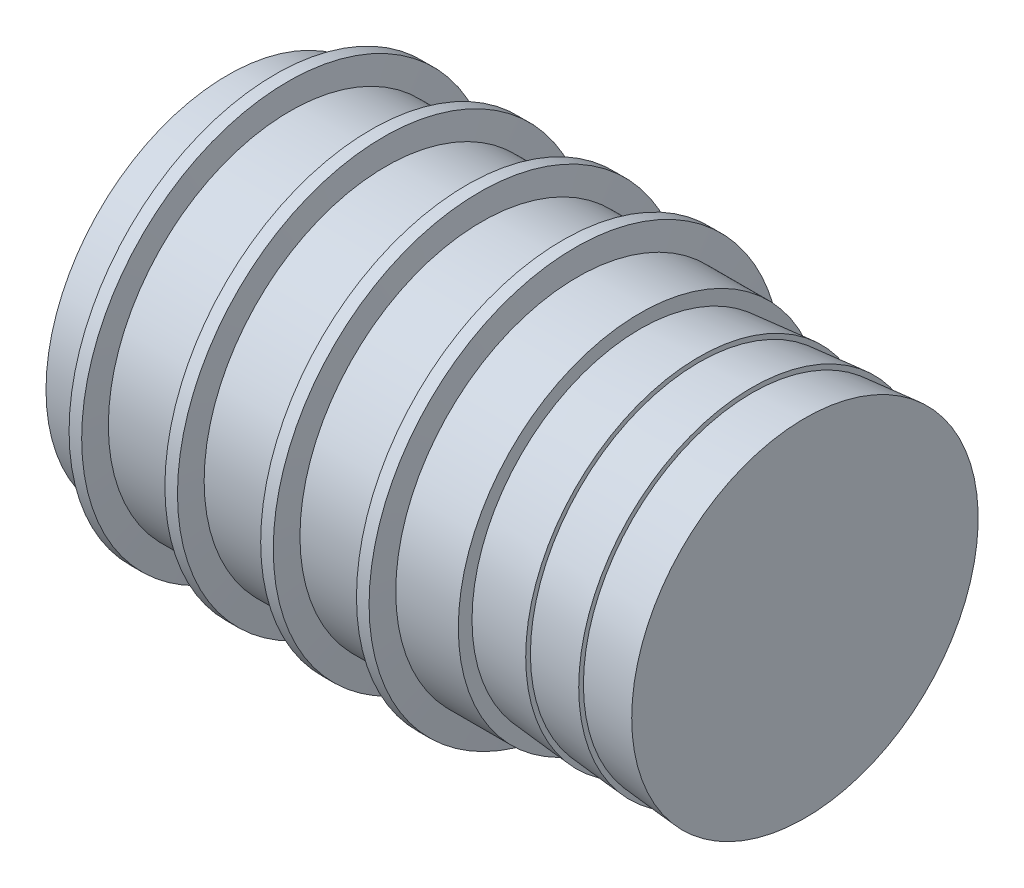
ISO-10303-21;
HEADER;
FILE_DESCRIPTION(('STEP AP214'),'2;1');
FILE_NAME('part.step','',(''),(''),'','','');
FILE_SCHEMA(('AUTOMOTIVE_DESIGN { 1 0 10303 214 1 1 1 1 }'));
ENDSEC;
DATA;
#1=APPLICATION_CONTEXT('core data for automotive mechanical design processes');
#2=APPLICATION_PROTOCOL_DEFINITION('international standard','automotive_design',2000,#1);
#3=PRODUCT_CONTEXT('',#1,'mechanical');
#4=PRODUCT('Part','Part','',(#3));
#5=PRODUCT_RELATED_PRODUCT_CATEGORY('part','',(#4));
#6=PRODUCT_DEFINITION_FORMATION('','',#4);
#7=PRODUCT_DEFINITION_CONTEXT('part definition',#1,'design');
#8=PRODUCT_DEFINITION('design','',#6,#7);
#9=PRODUCT_DEFINITION_SHAPE('','',#8);
#10=(LENGTH_UNIT() NAMED_UNIT(*) SI_UNIT(.MILLI.,.METRE.));
#11=(NAMED_UNIT(*) PLANE_ANGLE_UNIT() SI_UNIT($,.RADIAN.));
#12=(NAMED_UNIT(*) SI_UNIT($,.STERADIAN.) SOLID_ANGLE_UNIT());
#13=UNCERTAINTY_MEASURE_WITH_UNIT(LENGTH_MEASURE(1.E-05),#10,'distance_accuracy_value','');
#14=(GEOMETRIC_REPRESENTATION_CONTEXT(3) GLOBAL_UNCERTAINTY_ASSIGNED_CONTEXT((#13)) GLOBAL_UNIT_ASSIGNED_CONTEXT((#10,
#11,#12)) REPRESENTATION_CONTEXT('',''));
#15=CARTESIAN_POINT('',(0.,0.,0.));
#16=DIRECTION('',(0.,0.,1.));
#17=DIRECTION('',(1.,0.,0.));
#18=AXIS2_PLACEMENT_3D('',#15,#16,#17);
#19=CARTESIAN_POINT('',(14.,0.,0.));
#20=DIRECTION('',(1.,0.,0.));
#21=DIRECTION('',(0.,0.,-1.));
#22=AXIS2_PLACEMENT_3D('',#19,#20,#21);
#23=PLANE('',#22);
#24=CARTESIAN_POINT('',(14.,0.,0.));
#25=DIRECTION('',(-1.,0.,0.));
#26=DIRECTION('',(0.,0.,1.));
#27=AXIS2_PLACEMENT_3D('',#24,#25,#26);
#28=CIRCLE('',#27,4.20134201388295);
#29=CARTESIAN_POINT('',(14.,0.,4.20134201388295));
#30=VERTEX_POINT('',#29);
#31=EDGE_CURVE('E9',#30,#30,#28,.T.);
#32=ORIENTED_EDGE('',*,*,#31,.F.);
#33=EDGE_LOOP('',(#32));
#34=FACE_BOUND('',#33,.T.);
#35=ADVANCED_FACE('F14',(#34),#23,.T.);
#36=CARTESIAN_POINT('',(12.7144174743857,0.,0.));
#37=DIRECTION('',(1.,0.,0.));
#38=DIRECTION('',(0.,0.,-1.));
#39=AXIS2_PLACEMENT_3D('',#36,#37,#38);
#40=CONICAL_SURFACE('',#39,4.08715670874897,0.0885874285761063);
#41=ORIENTED_EDGE('',*,*,#31,.T.);
#42=EDGE_LOOP('',(#41));
#43=FACE_BOUND('',#42,.T.);
#44=CARTESIAN_POINT('',(12.7144174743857,0.,0.));
#45=DIRECTION('',(-1.,0.,0.));
#46=DIRECTION('',(0.,0.,1.));
#47=AXIS2_PLACEMENT_3D('',#44,#45,#46);
#48=CIRCLE('',#47,4.08715670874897);
#49=CARTESIAN_POINT('',(12.7144174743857,0.,4.08715670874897));
#50=VERTEX_POINT('',#49);
#51=EDGE_CURVE('E20',#50,#50,#48,.T.);
#52=ORIENTED_EDGE('',*,*,#51,.F.);
#53=EDGE_LOOP('',(#52));
#54=FACE_BOUND('',#53,.T.);
#55=ADVANCED_FACE('F146',(#43,#54),#40,.T.);
#56=CARTESIAN_POINT('',(12.7144174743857,0.,0.));
#57=DIRECTION('',(1.,0.,0.));
#58=DIRECTION('',(0.,0.,-1.));
#59=AXIS2_PLACEMENT_3D('',#56,#57,#58);
#60=PLANE('',#59);
#61=ORIENTED_EDGE('',*,*,#51,.T.);
#62=EDGE_LOOP('',(#61));
#63=FACE_BOUND('',#62,.T.);
#64=CARTESIAN_POINT('',(12.7144174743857,0.,0.));
#65=DIRECTION('',(-1.,0.,0.));
#66=DIRECTION('',(0.,0.,1.));
#67=AXIS2_PLACEMENT_3D('',#64,#65,#66);
#68=CIRCLE('',#67,4.20134201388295);
#69=CARTESIAN_POINT('',(12.7144174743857,0.,4.20134201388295));
#70=VERTEX_POINT('',#69);
#71=EDGE_CURVE('E24',#70,#70,#68,.T.);
#72=ORIENTED_EDGE('',*,*,#71,.F.);
#73=EDGE_LOOP('',(#72));
#74=FACE_BOUND('',#73,.T.);
#75=ADVANCED_FACE('F152',(#63,#74),#60,.T.);
#76=CARTESIAN_POINT('',(11.4288349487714,0.,0.));
#77=DIRECTION('',(1.,0.,0.));
#78=DIRECTION('',(0.,0.,-1.));
#79=AXIS2_PLACEMENT_3D('',#76,#77,#78);
#80=CONICAL_SURFACE('',#79,4.08715670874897,0.0885874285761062);
#81=ORIENTED_EDGE('',*,*,#71,.T.);
#82=EDGE_LOOP('',(#81));
#83=FACE_BOUND('',#82,.T.);
#84=CARTESIAN_POINT('',(11.4288349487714,0.,0.));
#85=DIRECTION('',(-1.,0.,0.));
#86=DIRECTION('',(0.,0.,1.));
#87=AXIS2_PLACEMENT_3D('',#84,#85,#86);
#88=CIRCLE('',#87,4.08715670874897);
#89=CARTESIAN_POINT('',(11.4288349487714,0.,4.08715670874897));
#90=VERTEX_POINT('',#89);
#91=EDGE_CURVE('E28',#90,#90,#88,.T.);
#92=ORIENTED_EDGE('',*,*,#91,.F.);
#93=EDGE_LOOP('',(#92));
#94=FACE_BOUND('',#93,.T.);
#95=ADVANCED_FACE('F157',(#83,#94),#80,.T.);
#96=CARTESIAN_POINT('',(11.4288349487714,0.,0.));
#97=DIRECTION('',(1.,0.,0.));
#98=DIRECTION('',(0.,0.,-1.));
#99=AXIS2_PLACEMENT_3D('',#96,#97,#98);
#100=PLANE('',#99);
#101=ORIENTED_EDGE('',*,*,#91,.T.);
#102=EDGE_LOOP('',(#101));
#103=FACE_BOUND('',#102,.T.);
#104=CARTESIAN_POINT('',(11.4288349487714,0.,0.));
#105=DIRECTION('',(-1.,0.,0.));
#106=DIRECTION('',(0.,0.,1.));
#107=AXIS2_PLACEMENT_3D('',#104,#105,#106);
#108=CIRCLE('',#107,4.20134201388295);
#109=CARTESIAN_POINT('',(11.4288349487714,0.,4.20134201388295));
#110=VERTEX_POINT('',#109);
#111=EDGE_CURVE('E33',#110,#110,#108,.T.);
#112=ORIENTED_EDGE('',*,*,#111,.F.);
#113=EDGE_LOOP('',(#112));
#114=FACE_BOUND('',#113,.T.);
#115=ADVANCED_FACE('F163',(#103,#114),#100,.T.);
#116=CARTESIAN_POINT('',(10.,0.,0.));
#117=DIRECTION('',(1.,0.,0.));
#118=DIRECTION('',(0.,0.,-1.));
#119=AXIS2_PLACEMENT_3D('',#116,#117,#118);
#120=CONICAL_SURFACE('',#119,4.07443304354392,0.0885874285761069);
#121=ORIENTED_EDGE('',*,*,#111,.T.);
#122=EDGE_LOOP('',(#121));
#123=FACE_BOUND('',#122,.T.);
#124=CARTESIAN_POINT('',(10.,0.,0.));
#125=DIRECTION('',(-1.,0.,0.));
#126=DIRECTION('',(0.,0.,1.));
#127=AXIS2_PLACEMENT_3D('',#124,#125,#126);
#128=CIRCLE('',#127,4.07443304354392);
#129=CARTESIAN_POINT('',(10.,0.,4.07443304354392));
#130=VERTEX_POINT('',#129);
#131=EDGE_CURVE('E36',#130,#130,#128,.T.);
#132=ORIENTED_EDGE('',*,*,#131,.F.);
#133=EDGE_LOOP('',(#132));
#134=FACE_BOUND('',#133,.T.);
#135=ADVANCED_FACE('F167',(#123,#134),#120,.T.);
#136=CARTESIAN_POINT('',(10.,0.,0.));
#137=DIRECTION('',(1.,0.,0.));
#138=DIRECTION('',(0.,0.,-1.));
#139=AXIS2_PLACEMENT_3D('',#136,#137,#138);
#140=PLANE('',#139);
#141=ORIENTED_EDGE('',*,*,#131,.T.);
#142=EDGE_LOOP('',(#141));
#143=FACE_BOUND('',#142,.T.);
#144=CARTESIAN_POINT('',(10.,0.,0.));
#145=DIRECTION('',(-1.,0.,0.));
#146=DIRECTION('',(0.,0.,1.));
#147=AXIS2_PLACEMENT_3D('',#144,#145,#146);
#148=CIRCLE('',#147,4.40692807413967);
#149=CARTESIAN_POINT('',(10.,0.,4.40692807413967));
#150=VERTEX_POINT('',#149);
#151=EDGE_CURVE('E39',#150,#150,#148,.T.);
#152=ORIENTED_EDGE('',*,*,#151,.F.);
#153=EDGE_LOOP('',(#152));
#154=FACE_BOUND('',#153,.T.);
#155=ADVANCED_FACE('F171',(#143,#154),#140,.T.);
#156=CARTESIAN_POINT('',(0.,0.,0.));
#157=DIRECTION('',(-1.,0.,0.));
#158=DIRECTION('',(0.,0.,1.));
#159=AXIS2_PLACEMENT_3D('',#156,#157,#158);
#160=CYLINDRICAL_SURFACE('',#159,4.40692807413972);
#161=CARTESIAN_POINT('',(8.48265334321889,0.,0.));
#162=DIRECTION('',(-1.,0.,0.));
#163=DIRECTION('',(0.,0.,1.));
#164=AXIS2_PLACEMENT_3D('',#161,#162,#163);
#165=CIRCLE('',#164,4.40692807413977);
#166=CARTESIAN_POINT('',(8.48265334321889,0.,4.40692807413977));
#167=VERTEX_POINT('',#166);
#168=EDGE_CURVE('E42',#167,#167,#165,.T.);
#169=ORIENTED_EDGE('',*,*,#168,.F.);
#170=EDGE_LOOP('',(#169));
#171=FACE_BOUND('',#170,.T.);
#172=ORIENTED_EDGE('',*,*,#151,.T.);
#173=EDGE_LOOP('',(#172));
#174=FACE_BOUND('',#173,.T.);
#175=ADVANCED_FACE('F175',(#171,#174),#160,.T.);
#176=CARTESIAN_POINT('',(8.48265334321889,0.,0.));
#177=DIRECTION('',(-1.,0.,0.));
#178=DIRECTION('',(0.,0.,1.));
#179=AXIS2_PLACEMENT_3D('',#176,#177,#178);
#180=CONICAL_SURFACE('',#179,4.40692807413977,1.48000585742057);
#181=CARTESIAN_POINT('',(8.42865962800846,0.,0.));
#182=DIRECTION('',(-1.,0.,0.));
#183=DIRECTION('',(0.,0.,1.));
#184=AXIS2_PLACEMENT_3D('',#181,#182,#183);
#185=CIRCLE('',#184,5.0000000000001);
#186=CARTESIAN_POINT('',(8.42865962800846,0.,5.0000000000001));
#187=VERTEX_POINT('',#186);
#188=EDGE_CURVE('E45',#187,#187,#185,.T.);
#189=ORIENTED_EDGE('',*,*,#188,.F.);
#190=EDGE_LOOP('',(#189));
#191=FACE_BOUND('',#190,.T.);
#192=ORIENTED_EDGE('',*,*,#168,.T.);
#193=EDGE_LOOP('',(#192));
#194=FACE_BOUND('',#193,.T.);
#195=ADVANCED_FACE('F179',(#191,#194),#180,.T.);
#196=CARTESIAN_POINT('',(0.,0.,0.));
#197=DIRECTION('',(-1.,0.,0.));
#198=DIRECTION('',(0.,0.,1.));
#199=AXIS2_PLACEMENT_3D('',#196,#197,#198);
#200=CYLINDRICAL_SURFACE('',#199,5.0000000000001);
#201=ORIENTED_EDGE('',*,*,#188,.T.);
#202=EDGE_LOOP('',(#201));
#203=FACE_BOUND('',#202,.T.);
#204=CARTESIAN_POINT('',(8.12328147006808,0.,0.));
#205=DIRECTION('',(-1.,0.,0.));
#206=DIRECTION('',(0.,0.,1.));
#207=AXIS2_PLACEMENT_3D('',#204,#205,#206);
#208=CIRCLE('',#207,5.0000000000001);
#209=CARTESIAN_POINT('',(8.12328147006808,0.,5.0000000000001));
#210=VERTEX_POINT('',#209);
#211=EDGE_CURVE('E48',#210,#210,#208,.T.);
#212=ORIENTED_EDGE('',*,*,#211,.F.);
#213=EDGE_LOOP('',(#212));
#214=FACE_BOUND('',#213,.T.);
#215=ADVANCED_FACE('F183',(#203,#214),#200,.T.);
#216=CARTESIAN_POINT('',(8.06928775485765,0.,0.));
#217=DIRECTION('',(1.,0.,0.));
#218=DIRECTION('',(0.,0.,-1.));
#219=AXIS2_PLACEMENT_3D('',#216,#217,#218);
#220=CONICAL_SURFACE('',#219,4.40692807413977,1.48000585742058);
#221=ORIENTED_EDGE('',*,*,#211,.T.);
#222=EDGE_LOOP('',(#221));
#223=FACE_BOUND('',#222,.T.);
#224=CARTESIAN_POINT('',(8.06928775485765,0.,0.));
#225=DIRECTION('',(-1.,0.,0.));
#226=DIRECTION('',(0.,0.,1.));
#227=AXIS2_PLACEMENT_3D('',#224,#225,#226);
#228=CIRCLE('',#227,4.40692807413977);
#229=CARTESIAN_POINT('',(8.06928775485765,0.,4.40692807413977));
#230=VERTEX_POINT('',#229);
#231=EDGE_CURVE('E51',#230,#230,#228,.T.);
#232=ORIENTED_EDGE('',*,*,#231,.F.);
#233=EDGE_LOOP('',(#232));
#234=FACE_BOUND('',#233,.T.);
#235=ADVANCED_FACE('F187',(#223,#234),#220,.T.);
#236=CARTESIAN_POINT('',(0.,0.,0.));
#237=DIRECTION('',(-1.,0.,0.));
#238=DIRECTION('',(0.,0.,1.));
#239=AXIS2_PLACEMENT_3D('',#236,#237,#238);
#240=CYLINDRICAL_SURFACE('',#239,4.40692807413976);
#241=CARTESIAN_POINT('',(6.15915877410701,0.,0.));
#242=DIRECTION('',(-1.,0.,0.));
#243=DIRECTION('',(0.,0.,1.));
#244=AXIS2_PLACEMENT_3D('',#241,#242,#243);
#245=CIRCLE('',#244,4.40692807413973);
#246=CARTESIAN_POINT('',(6.15915877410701,0.,4.40692807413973));
#247=VERTEX_POINT('',#246);
#248=EDGE_CURVE('E54',#247,#247,#245,.T.);
#249=ORIENTED_EDGE('',*,*,#248,.F.);
#250=EDGE_LOOP('',(#249));
#251=FACE_BOUND('',#250,.T.);
#252=ORIENTED_EDGE('',*,*,#231,.T.);
#253=EDGE_LOOP('',(#252));
#254=FACE_BOUND('',#253,.T.);
#255=ADVANCED_FACE('F191',(#251,#254),#240,.T.);
#256=CARTESIAN_POINT('',(6.15915877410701,0.,0.));
#257=DIRECTION('',(-1.,0.,0.));
#258=DIRECTION('',(0.,0.,1.));
#259=AXIS2_PLACEMENT_3D('',#256,#257,#258);
#260=CONICAL_SURFACE('',#259,4.40692807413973,1.48000585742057);
#261=CARTESIAN_POINT('',(6.10516505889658,0.,0.));
#262=DIRECTION('',(-1.,0.,0.));
#263=DIRECTION('',(0.,0.,1.));
#264=AXIS2_PLACEMENT_3D('',#261,#262,#263);
#265=CIRCLE('',#264,5.00000000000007);
#266=CARTESIAN_POINT('',(6.10516505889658,0.,5.00000000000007));
#267=VERTEX_POINT('',#266);
#268=EDGE_CURVE('E57',#267,#267,#265,.T.);
#269=ORIENTED_EDGE('',*,*,#268,.F.);
#270=EDGE_LOOP('',(#269));
#271=FACE_BOUND('',#270,.T.);
#272=ORIENTED_EDGE('',*,*,#248,.T.);
#273=EDGE_LOOP('',(#272));
#274=FACE_BOUND('',#273,.T.);
#275=ADVANCED_FACE('F195',(#271,#274),#260,.T.);
#276=CARTESIAN_POINT('',(0.,0.,0.));
#277=DIRECTION('',(-1.,0.,0.));
#278=DIRECTION('',(0.,0.,1.));
#279=AXIS2_PLACEMENT_3D('',#276,#277,#278);
#280=CYLINDRICAL_SURFACE('',#279,5.00000000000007);
#281=ORIENTED_EDGE('',*,*,#268,.T.);
#282=EDGE_LOOP('',(#281));
#283=FACE_BOUND('',#282,.T.);
#284=CARTESIAN_POINT('',(5.7997869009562,0.,0.));
#285=DIRECTION('',(-1.,0.,0.));
#286=DIRECTION('',(0.,0.,1.));
#287=AXIS2_PLACEMENT_3D('',#284,#285,#286);
#288=CIRCLE('',#287,5.00000000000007);
#289=CARTESIAN_POINT('',(5.7997869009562,0.,5.00000000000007));
#290=VERTEX_POINT('',#289);
#291=EDGE_CURVE('E60',#290,#290,#288,.T.);
#292=ORIENTED_EDGE('',*,*,#291,.F.);
#293=EDGE_LOOP('',(#292));
#294=FACE_BOUND('',#293,.T.);
#295=ADVANCED_FACE('F199',(#283,#294),#280,.T.);
#296=CARTESIAN_POINT('',(5.74579318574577,0.,0.));
#297=DIRECTION('',(1.,0.,0.));
#298=DIRECTION('',(0.,0.,-1.));
#299=AXIS2_PLACEMENT_3D('',#296,#297,#298);
#300=CONICAL_SURFACE('',#299,4.40692807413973,1.48000585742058);
#301=ORIENTED_EDGE('',*,*,#291,.T.);
#302=EDGE_LOOP('',(#301));
#303=FACE_BOUND('',#302,.T.);
#304=CARTESIAN_POINT('',(5.74579318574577,0.,0.));
#305=DIRECTION('',(-1.,0.,0.));
#306=DIRECTION('',(0.,0.,1.));
#307=AXIS2_PLACEMENT_3D('',#304,#305,#306);
#308=CIRCLE('',#307,4.40692807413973);
#309=CARTESIAN_POINT('',(5.74579318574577,0.,4.40692807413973));
#310=VERTEX_POINT('',#309);
#311=EDGE_CURVE('E63',#310,#310,#308,.T.);
#312=ORIENTED_EDGE('',*,*,#311,.F.);
#313=EDGE_LOOP('',(#312));
#314=FACE_BOUND('',#313,.T.);
#315=ADVANCED_FACE('F203',(#303,#314),#300,.T.);
#316=CARTESIAN_POINT('',(0.,0.,0.));
#317=DIRECTION('',(-1.,0.,0.));
#318=DIRECTION('',(0.,0.,1.));
#319=AXIS2_PLACEMENT_3D('',#316,#317,#318);
#320=CYLINDRICAL_SURFACE('',#319,4.40692807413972);
#321=CARTESIAN_POINT('',(3.83566420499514,0.,0.));
#322=DIRECTION('',(-1.,0.,0.));
#323=DIRECTION('',(0.,0.,1.));
#324=AXIS2_PLACEMENT_3D('',#321,#322,#323);
#325=CIRCLE('',#324,4.4069280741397);
#326=CARTESIAN_POINT('',(3.83566420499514,0.,4.4069280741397));
#327=VERTEX_POINT('',#326);
#328=EDGE_CURVE('E66',#327,#327,#325,.T.);
#329=ORIENTED_EDGE('',*,*,#328,.F.);
#330=EDGE_LOOP('',(#329));
#331=FACE_BOUND('',#330,.T.);
#332=ORIENTED_EDGE('',*,*,#311,.T.);
#333=EDGE_LOOP('',(#332));
#334=FACE_BOUND('',#333,.T.);
#335=ADVANCED_FACE('F207',(#331,#334),#320,.T.);
#336=CARTESIAN_POINT('',(3.83566420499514,0.,0.));
#337=DIRECTION('',(-1.,0.,0.));
#338=DIRECTION('',(0.,0.,1.));
#339=AXIS2_PLACEMENT_3D('',#336,#337,#338);
#340=CONICAL_SURFACE('',#339,4.4069280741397,1.48000585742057);
#341=CARTESIAN_POINT('',(3.7816704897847,0.,0.));
#342=DIRECTION('',(-1.,0.,0.));
#343=DIRECTION('',(0.,0.,1.));
#344=AXIS2_PLACEMENT_3D('',#341,#342,#343);
#345=CIRCLE('',#344,5.);
#346=CARTESIAN_POINT('',(3.7816704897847,0.,5.));
#347=VERTEX_POINT('',#346);
#348=EDGE_CURVE('E69',#347,#347,#345,.T.);
#349=ORIENTED_EDGE('',*,*,#348,.F.);
#350=EDGE_LOOP('',(#349));
#351=FACE_BOUND('',#350,.T.);
#352=ORIENTED_EDGE('',*,*,#328,.T.);
#353=EDGE_LOOP('',(#352));
#354=FACE_BOUND('',#353,.T.);
#355=ADVANCED_FACE('F211',(#351,#354),#340,.T.);
#356=CARTESIAN_POINT('',(0.,0.,0.));
#357=DIRECTION('',(-1.,0.,0.));
#358=DIRECTION('',(0.,0.,1.));
#359=AXIS2_PLACEMENT_3D('',#356,#357,#358);
#360=CYLINDRICAL_SURFACE('',#359,5.);
#361=ORIENTED_EDGE('',*,*,#348,.T.);
#362=EDGE_LOOP('',(#361));
#363=FACE_BOUND('',#362,.T.);
#364=CARTESIAN_POINT('',(3.47629233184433,0.,0.));
#365=DIRECTION('',(-1.,0.,0.));
#366=DIRECTION('',(0.,0.,1.));
#367=AXIS2_PLACEMENT_3D('',#364,#365,#366);
#368=CIRCLE('',#367,5.);
#369=CARTESIAN_POINT('',(3.47629233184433,0.,5.));
#370=VERTEX_POINT('',#369);
#371=EDGE_CURVE('E72',#370,#370,#368,.T.);
#372=ORIENTED_EDGE('',*,*,#371,.F.);
#373=EDGE_LOOP('',(#372));
#374=FACE_BOUND('',#373,.T.);
#375=ADVANCED_FACE('F215',(#363,#374),#360,.T.);
#376=CARTESIAN_POINT('',(3.42229861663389,0.,0.));
#377=DIRECTION('',(1.,0.,0.));
#378=DIRECTION('',(0.,0.,-1.));
#379=AXIS2_PLACEMENT_3D('',#376,#377,#378);
#380=CONICAL_SURFACE('',#379,4.4069280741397,1.48000585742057);
#381=ORIENTED_EDGE('',*,*,#371,.T.);
#382=EDGE_LOOP('',(#381));
#383=FACE_BOUND('',#382,.T.);
#384=CARTESIAN_POINT('',(3.42229861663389,0.,0.));
#385=DIRECTION('',(-1.,0.,0.));
#386=DIRECTION('',(0.,0.,1.));
#387=AXIS2_PLACEMENT_3D('',#384,#385,#386);
#388=CIRCLE('',#387,4.4069280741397);
#389=CARTESIAN_POINT('',(3.42229861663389,0.,4.4069280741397));
#390=VERTEX_POINT('',#389);
#391=EDGE_CURVE('E75',#390,#390,#388,.T.);
#392=ORIENTED_EDGE('',*,*,#391,.F.);
#393=EDGE_LOOP('',(#392));
#394=FACE_BOUND('',#393,.T.);
#395=ADVANCED_FACE('F219',(#383,#394),#380,.T.);
#396=CARTESIAN_POINT('',(0.,0.,0.));
#397=DIRECTION('',(-1.,0.,0.));
#398=DIRECTION('',(0.,0.,1.));
#399=AXIS2_PLACEMENT_3D('',#396,#397,#398);
#400=CYLINDRICAL_SURFACE('',#399,4.40692807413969);
#401=CARTESIAN_POINT('',(1.51216963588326,0.,0.));
#402=DIRECTION('',(-1.,0.,0.));
#403=DIRECTION('',(0.,0.,1.));
#404=AXIS2_PLACEMENT_3D('',#401,#402,#403);
#405=CIRCLE('',#404,4.40692807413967);
#406=CARTESIAN_POINT('',(1.51216963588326,0.,4.40692807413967));
#407=VERTEX_POINT('',#406);
#408=EDGE_CURVE('E78',#407,#407,#405,.T.);
#409=ORIENTED_EDGE('',*,*,#408,.F.);
#410=EDGE_LOOP('',(#409));
#411=FACE_BOUND('',#410,.T.);
#412=ORIENTED_EDGE('',*,*,#391,.T.);
#413=EDGE_LOOP('',(#412));
#414=FACE_BOUND('',#413,.T.);
#415=ADVANCED_FACE('F223',(#411,#414),#400,.T.);
#416=CARTESIAN_POINT('',(1.51216963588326,0.,0.));
#417=DIRECTION('',(-1.,0.,0.));
#418=DIRECTION('',(0.,0.,1.));
#419=AXIS2_PLACEMENT_3D('',#416,#417,#418);
#420=CONICAL_SURFACE('',#419,4.40692807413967,1.48000585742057);
#421=CARTESIAN_POINT('',(1.45817592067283,0.,0.));
#422=DIRECTION('',(-1.,0.,0.));
#423=DIRECTION('',(0.,0.,1.));
#424=AXIS2_PLACEMENT_3D('',#421,#422,#423);
#425=CIRCLE('',#424,5.);
#426=CARTESIAN_POINT('',(1.45817592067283,0.,5.));
#427=VERTEX_POINT('',#426);
#428=EDGE_CURVE('E81',#427,#427,#425,.T.);
#429=ORIENTED_EDGE('',*,*,#428,.F.);
#430=EDGE_LOOP('',(#429));
#431=FACE_BOUND('',#430,.T.);
#432=ORIENTED_EDGE('',*,*,#408,.T.);
#433=EDGE_LOOP('',(#432));
#434=FACE_BOUND('',#433,.T.);
#435=ADVANCED_FACE('F227',(#431,#434),#420,.T.);
#436=CARTESIAN_POINT('',(0.,0.,0.));
#437=DIRECTION('',(-1.,0.,0.));
#438=DIRECTION('',(0.,0.,1.));
#439=AXIS2_PLACEMENT_3D('',#436,#437,#438);
#440=CYLINDRICAL_SURFACE('',#439,5.);
#441=ORIENTED_EDGE('',*,*,#428,.T.);
#442=EDGE_LOOP('',(#441));
#443=FACE_BOUND('',#442,.T.);
#444=CARTESIAN_POINT('',(1.15279776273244,0.,0.));
#445=DIRECTION('',(-1.,0.,0.));
#446=DIRECTION('',(0.,0.,1.));
#447=AXIS2_PLACEMENT_3D('',#444,#445,#446);
#448=CIRCLE('',#447,5.);
#449=CARTESIAN_POINT('',(1.15279776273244,0.,5.));
#450=VERTEX_POINT('',#449);
#451=EDGE_CURVE('E84',#450,#450,#448,.T.);
#452=ORIENTED_EDGE('',*,*,#451,.F.);
#453=EDGE_LOOP('',(#452));
#454=FACE_BOUND('',#453,.T.);
#455=ADVANCED_FACE('F142',(#443,#454),#440,.T.);
#456=CARTESIAN_POINT('',(1.09880404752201,0.,0.));
#457=DIRECTION('',(1.,0.,0.));
#458=DIRECTION('',(0.,0.,-1.));
#459=AXIS2_PLACEMENT_3D('',#456,#457,#458);
#460=CONICAL_SURFACE('',#459,4.40692807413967,1.48000585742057);
#461=ORIENTED_EDGE('',*,*,#451,.T.);
#462=EDGE_LOOP('',(#461));
#463=FACE_BOUND('',#462,.T.);
#464=CARTESIAN_POINT('',(1.09880404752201,0.,0.));
#465=DIRECTION('',(-1.,0.,0.));
#466=DIRECTION('',(0.,0.,1.));
#467=AXIS2_PLACEMENT_3D('',#464,#465,#466);
#468=CIRCLE('',#467,4.40692807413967);
#469=CARTESIAN_POINT('',(1.09880404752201,0.,4.40692807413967));
#470=VERTEX_POINT('',#469);
#471=EDGE_CURVE('E87',#470,#470,#468,.T.);
#472=ORIENTED_EDGE('',*,*,#471,.F.);
#473=EDGE_LOOP('',(#472));
#474=FACE_BOUND('',#473,.T.);
#475=ADVANCED_FACE('F134',(#463,#474),#460,.T.);
#476=CARTESIAN_POINT('',(0.,0.,0.));
#477=DIRECTION('',(-1.,0.,0.));
#478=DIRECTION('',(0.,0.,1.));
#479=AXIS2_PLACEMENT_3D('',#476,#477,#478);
#480=CYLINDRICAL_SURFACE('',#479,4.40692807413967);
#481=ORIENTED_EDGE('',*,*,#471,.T.);
#482=EDGE_LOOP('',(#481));
#483=FACE_BOUND('',#482,.T.);
#484=CARTESIAN_POINT('',(0.,0.,0.));
#485=DIRECTION('',(-1.,0.,0.));
#486=DIRECTION('',(0.,0.,1.));
#487=AXIS2_PLACEMENT_3D('',#484,#485,#486);
#488=CIRCLE('',#487,4.40692807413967);
#489=CARTESIAN_POINT('',(0.,0.,4.40692807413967));
#490=VERTEX_POINT('',#489);
#491=EDGE_CURVE('E90',#490,#490,#488,.T.);
#492=ORIENTED_EDGE('',*,*,#491,.F.);
#493=EDGE_LOOP('',(#492));
#494=FACE_BOUND('',#493,.T.);
#495=ADVANCED_FACE('F129',(#483,#494),#480,.T.);
#496=CARTESIAN_POINT('',(0.,0.,0.));
#497=DIRECTION('',(-1.,0.,0.));
#498=DIRECTION('',(0.,0.,1.));
#499=AXIS2_PLACEMENT_3D('',#496,#497,#498);
#500=PLANE('',#499);
#501=CARTESIAN_POINT('',(0.,0.,0.));
#502=DIRECTION('',(-1.,0.,0.));
#503=DIRECTION('',(0.,0.,1.));
#504=AXIS2_PLACEMENT_3D('',#501,#502,#503);
#505=CIRCLE('',#504,4.);
#506=CARTESIAN_POINT('',(0.,0.,4.));
#507=VERTEX_POINT('',#506);
#508=EDGE_CURVE('E96',#507,#507,#505,.T.);
#509=ORIENTED_EDGE('',*,*,#508,.F.);
#510=EDGE_LOOP('',(#509));
#511=FACE_BOUND('',#510,.T.);
#512=ORIENTED_EDGE('',*,*,#491,.T.);
#513=EDGE_LOOP('',(#512));
#514=FACE_BOUND('',#513,.T.);
#515=ADVANCED_FACE('F123',(#511,#514),#500,.T.);
#516=CARTESIAN_POINT('',(0.,0.,0.));
#517=DIRECTION('',(-1.,0.,0.));
#518=DIRECTION('',(0.,0.,1.));
#519=AXIS2_PLACEMENT_3D('',#516,#517,#518);
#520=CONICAL_SURFACE('',#519,4.,0.0349065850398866);
#521=CARTESIAN_POINT('',(2.,0.,0.));
#522=DIRECTION('',(-1.,0.,0.));
#523=DIRECTION('',(0.,0.,1.));
#524=AXIS2_PLACEMENT_3D('',#521,#522,#523);
#525=CIRCLE('',#524,3.93015846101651);
#526=CARTESIAN_POINT('',(2.,0.,3.93015846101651));
#527=VERTEX_POINT('',#526);
#528=EDGE_CURVE('E93',#527,#527,#525,.T.);
#529=ORIENTED_EDGE('',*,*,#528,.F.);
#530=EDGE_LOOP('',(#529));
#531=FACE_BOUND('',#530,.T.);
#532=ORIENTED_EDGE('',*,*,#508,.T.);
#533=EDGE_LOOP('',(#532));
#534=FACE_BOUND('',#533,.T.);
#535=ADVANCED_FACE('F117',(#531,#534),#520,.F.);
#536=CARTESIAN_POINT('',(2.,0.,0.));
#537=DIRECTION('',(-1.,0.,0.));
#538=DIRECTION('',(0.,0.,1.));
#539=AXIS2_PLACEMENT_3D('',#536,#537,#538);
#540=PLANE('',#539);
#541=CARTESIAN_POINT('',(2.,0.,0.));
#542=DIRECTION('',(-1.,0.,0.));
#543=DIRECTION('',(0.,0.,1.));
#544=AXIS2_PLACEMENT_3D('',#541,#542,#543);
#545=CIRCLE('',#544,3.);
#546=CARTESIAN_POINT('',(2.,0.,3.));
#547=VERTEX_POINT('',#546);
#548=EDGE_CURVE('E100',#547,#547,#545,.T.);
#549=ORIENTED_EDGE('',*,*,#548,.F.);
#550=EDGE_LOOP('',(#549));
#551=FACE_BOUND('',#550,.T.);
#552=ORIENTED_EDGE('',*,*,#528,.T.);
#553=EDGE_LOOP('',(#552));
#554=FACE_BOUND('',#553,.T.);
#555=ADVANCED_FACE('F111',(#551,#554),#540,.T.);
#556=CARTESIAN_POINT('',(6.,0.,0.));
#557=DIRECTION('',(-1.,0.,0.));
#558=DIRECTION('',(0.,0.,1.));
#559=AXIS2_PLACEMENT_3D('',#556,#557,#558);
#560=CYLINDRICAL_SURFACE('',#559,3.);
#561=CARTESIAN_POINT('',(6.,0.,0.));
#562=DIRECTION('',(-1.,0.,0.));
#563=DIRECTION('',(0.,0.,1.));
#564=AXIS2_PLACEMENT_3D('',#561,#562,#563);
#565=CIRCLE('',#564,3.);
#566=CARTESIAN_POINT('',(6.,0.,3.));
#567=VERTEX_POINT('',#566);
#568=EDGE_CURVE('E99',#567,#567,#565,.T.);
#569=ORIENTED_EDGE('',*,*,#568,.F.);
#570=EDGE_LOOP('',(#569));
#571=FACE_BOUND('',#570,.T.);
#572=ORIENTED_EDGE('',*,*,#548,.T.);
#573=EDGE_LOOP('',(#572));
#574=FACE_BOUND('',#573,.T.);
#575=ADVANCED_FACE('F108',(#571,#574),#560,.F.);
#576=CARTESIAN_POINT('',(6.,0.,0.));
#577=DIRECTION('',(-1.,0.,0.));
#578=DIRECTION('',(0.,0.,1.));
#579=AXIS2_PLACEMENT_3D('',#576,#577,#578);
#580=PLANE('',#579);
#581=ORIENTED_EDGE('',*,*,#568,.T.);
#582=EDGE_LOOP('',(#581));
#583=FACE_BOUND('',#582,.T.);
#584=ADVANCED_FACE('F106',(#583),#580,.T.);
#585=CLOSED_SHELL('',(#35,#55,#75,#95,#115,#135,#155,#175,#195,#215,#235,#255,#275,#295,#315,
#335,#355,#375,#395,#415,#435,#455,#475,#495,#515,#535,#555,#575,#584));
#586=MANIFOLD_SOLID_BREP('B1',#585);
#587=ADVANCED_BREP_SHAPE_REPRESENTATION('',(#18,#586),#14);
#588=SHAPE_DEFINITION_REPRESENTATION(#9,#587);
ENDSEC;
END-ISO-10303-21;
